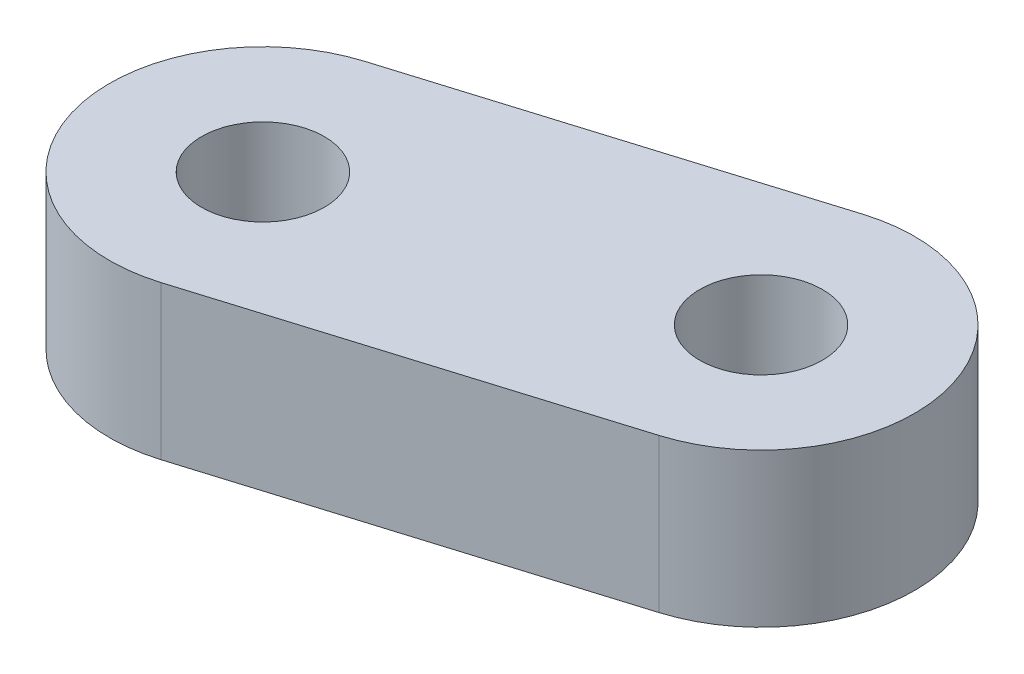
ISO-10303-21;
HEADER;
FILE_DESCRIPTION(('STEP AP214'),'2;1');
FILE_NAME('part.step','',(''),(''),'','','');
FILE_SCHEMA(('AUTOMOTIVE_DESIGN { 1 0 10303 214 1 1 1 1 }'));
ENDSEC;
DATA;
#1=APPLICATION_CONTEXT('core data for automotive mechanical design processes');
#2=APPLICATION_PROTOCOL_DEFINITION('international standard','automotive_design',2000,#1);
#3=PRODUCT_CONTEXT('',#1,'mechanical');
#4=PRODUCT('Part','Part','',(#3));
#5=PRODUCT_RELATED_PRODUCT_CATEGORY('part','',(#4));
#6=PRODUCT_DEFINITION_FORMATION('','',#4);
#7=PRODUCT_DEFINITION_CONTEXT('part definition',#1,'design');
#8=PRODUCT_DEFINITION('design','',#6,#7);
#9=PRODUCT_DEFINITION_SHAPE('','',#8);
#10=(LENGTH_UNIT() NAMED_UNIT(*) SI_UNIT(.MILLI.,.METRE.));
#11=(NAMED_UNIT(*) PLANE_ANGLE_UNIT() SI_UNIT($,.RADIAN.));
#12=(NAMED_UNIT(*) SI_UNIT($,.STERADIAN.) SOLID_ANGLE_UNIT());
#13=UNCERTAINTY_MEASURE_WITH_UNIT(LENGTH_MEASURE(1.E-05),#10,'distance_accuracy_value','');
#14=(GEOMETRIC_REPRESENTATION_CONTEXT(3) GLOBAL_UNCERTAINTY_ASSIGNED_CONTEXT((#13)) GLOBAL_UNIT_ASSIGNED_CONTEXT((#10,
#11,#12)) REPRESENTATION_CONTEXT('',''));
#15=CARTESIAN_POINT('',(0.,0.,0.));
#16=DIRECTION('',(0.,0.,1.));
#17=DIRECTION('',(1.,0.,0.));
#18=AXIS2_PLACEMENT_3D('',#15,#16,#17);
#19=CARTESIAN_POINT('',(12.4317873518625,-2.5,-3.80140279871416));
#20=DIRECTION('',(0.,-1.,0.));
#21=DIRECTION('',(-0.956291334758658,0.,0.292415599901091));
#22=AXIS2_PLACEMENT_3D('',#19,#20,#21);
#23=CYLINDRICAL_SURFACE('',#22,2.);
#24=CARTESIAN_POINT('',(12.4317873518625,-2.5,-3.80140279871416));
#25=DIRECTION('',(0.,-1.,0.));
#26=DIRECTION('',(-0.956291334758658,0.,0.292415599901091));
#27=AXIS2_PLACEMENT_3D('',#24,#25,#26);
#28=CIRCLE('',#27,2.);
#29=CARTESIAN_POINT('',(10.5192046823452,-2.5,-3.21657159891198));
#30=VERTEX_POINT('',#29);
#31=EDGE_CURVE('E83',#30,#30,#28,.T.);
#32=ORIENTED_EDGE('',*,*,#31,.T.);
#33=EDGE_LOOP('',(#32));
#34=FACE_BOUND('',#33,.T.);
#35=CARTESIAN_POINT('',(12.4317873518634,2.50000000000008,-3.80140279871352));
#36=DIRECTION('',(0.,-1.,0.));
#37=DIRECTION('',(-0.956291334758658,0.,0.29241559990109));
#38=AXIS2_PLACEMENT_3D('',#35,#36,#37);
#39=CIRCLE('',#38,2.);
#40=CARTESIAN_POINT('',(10.5192046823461,2.50000000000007,-3.21657159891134));
#41=VERTEX_POINT('',#40);
#42=EDGE_CURVE('E20',#41,#41,#39,.T.);
#43=ORIENTED_EDGE('',*,*,#42,.F.);
#44=EDGE_LOOP('',(#43));
#45=FACE_BOUND('',#44,.T.);
#46=ADVANCED_FACE('F16',(#34,#45),#23,.F.);
#47=CARTESIAN_POINT('',(0.,-2.5,0.));
#48=DIRECTION('',(0.,-1.,0.));
#49=DIRECTION('',(-0.956291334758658,0.,0.292415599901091));
#50=AXIS2_PLACEMENT_3D('',#47,#48,#49);
#51=CYLINDRICAL_SURFACE('',#50,2.);
#52=CARTESIAN_POINT('',(0.,-2.5,0.));
#53=DIRECTION('',(0.,-1.,0.));
#54=DIRECTION('',(-0.956291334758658,0.,0.292415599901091));
#55=AXIS2_PLACEMENT_3D('',#52,#53,#54);
#56=CIRCLE('',#55,2.);
#57=CARTESIAN_POINT('',(-1.91258266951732,-2.5,0.584831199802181));
#58=VERTEX_POINT('',#57);
#59=EDGE_CURVE('E98',#58,#58,#56,.T.);
#60=ORIENTED_EDGE('',*,*,#59,.T.);
#61=EDGE_LOOP('',(#60));
#62=FACE_BOUND('',#61,.T.);
#63=CARTESIAN_POINT('',(8.46545056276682E-13,2.5,6.53990750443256E-13));
#64=DIRECTION('',(0.,-1.,0.));
#65=DIRECTION('',(-0.956291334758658,0.,0.29241559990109));
#66=AXIS2_PLACEMENT_3D('',#63,#64,#65);
#67=CIRCLE('',#66,2.);
#68=CARTESIAN_POINT('',(-1.91258266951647,2.5,0.584831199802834));
#69=VERTEX_POINT('',#68);
#70=EDGE_CURVE('E78',#69,#69,#67,.T.);
#71=ORIENTED_EDGE('',*,*,#70,.F.);
#72=EDGE_LOOP('',(#71));
#73=FACE_BOUND('',#72,.T.);
#74=ADVANCED_FACE('F126',(#62,#73),#51,.F.);
#75=CARTESIAN_POINT('',(15.7511660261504,-2.49999999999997,-10.044937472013));
#76=DIRECTION('',(0.292415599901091,0.,0.956291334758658));
#77=DIRECTION('',(0.,1.,0.));
#78=AXIS2_PLACEMENT_3D('',#75,#76,#77);
#79=PLANE('',#78);
#80=DIRECTION('',(0.,1.,0.));
#81=VECTOR('',#80,1.);
#82=CARTESIAN_POINT('',(10.9697093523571,-2.49999999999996,-8.58285947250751));
#83=LINE('',#82,#81);
#84=CARTESIAN_POINT('',(10.9697093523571,-2.49999999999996,-8.58285947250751));
#85=VERTEX_POINT('',#84);
#86=CARTESIAN_POINT('',(10.9697093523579,2.50000000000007,-8.58285947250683));
#87=VERTEX_POINT('',#86);
#88=EDGE_CURVE('E87',#85,#87,#83,.T.);
#89=ORIENTED_EDGE('',*,*,#88,.F.);
#90=DIRECTION('',(0.956291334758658,0.,-0.292415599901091));
#91=VECTOR('',#90,1.);
#92=CARTESIAN_POINT('',(15.7511660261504,-2.49999999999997,-10.044937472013));
#93=LINE('',#92,#91);
#94=CARTESIAN_POINT('',(-1.46207799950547,-2.5,-4.78145667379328));
#95=VERTEX_POINT('',#94);
#96=EDGE_CURVE('E66',#85,#95,#93,.F.);
#97=ORIENTED_EDGE('',*,*,#96,.T.);
#98=DIRECTION('',(0.,1.,0.));
#99=VECTOR('',#98,1.);
#100=CARTESIAN_POINT('',(-1.46207799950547,-2.5,-4.78145667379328));
#101=LINE('',#100,#99);
#102=CARTESIAN_POINT('',(-1.4620779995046,2.50000000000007,-4.78145667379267));
#103=VERTEX_POINT('',#102);
#104=EDGE_CURVE('E59',#103,#95,#101,.F.);
#105=ORIENTED_EDGE('',*,*,#104,.F.);
#106=DIRECTION('',(-0.956291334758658,0.,0.29241559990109));
#107=VECTOR('',#106,1.);
#108=CARTESIAN_POINT('',(15.7511660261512,2.50000000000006,-10.0449374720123));
#109=LINE('',#108,#107);
#110=EDGE_CURVE('E63',#87,#103,#109,.T.);
#111=ORIENTED_EDGE('',*,*,#110,.F.);
#112=EDGE_LOOP('',(#89,#97,#105,#111));
#113=FACE_BOUND('',#112,.T.);
#114=ADVANCED_FACE('F61',(#113),#79,.F.);
#115=CARTESIAN_POINT('',(0.,-2.5,0.));
#116=DIRECTION('',(0.,1.,0.));
#117=DIRECTION('',(0.956291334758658,0.,-0.292415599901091));
#118=AXIS2_PLACEMENT_3D('',#115,#116,#117);
#119=CYLINDRICAL_SURFACE('',#118,5.);
#120=DIRECTION('',(0.,-1.,0.));
#121=VECTOR('',#120,1.);
#122=CARTESIAN_POINT('',(1.46207799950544,-2.5,4.78145667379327));
#123=LINE('',#122,#121);
#124=CARTESIAN_POINT('',(1.46207799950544,-2.5,4.78145667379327));
#125=VERTEX_POINT('',#124);
#126=CARTESIAN_POINT('',(1.46207799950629,2.5,4.78145667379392));
#127=VERTEX_POINT('',#126);
#128=EDGE_CURVE('E53',#125,#127,#123,.F.);
#129=ORIENTED_EDGE('',*,*,#128,.T.);
#130=CARTESIAN_POINT('',(8.46545056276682E-13,2.5,6.53990750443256E-13));
#131=DIRECTION('',(0.,1.,0.));
#132=DIRECTION('',(0.956291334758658,0.,-0.29241559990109));
#133=AXIS2_PLACEMENT_3D('',#130,#131,#132);
#134=CIRCLE('',#133,5.);
#135=EDGE_CURVE('E70',#127,#103,#134,.F.);
#136=ORIENTED_EDGE('',*,*,#135,.T.);
#137=ORIENTED_EDGE('',*,*,#104,.T.);
#138=CARTESIAN_POINT('',(0.,-2.5,0.));
#139=DIRECTION('',(0.,1.,0.));
#140=DIRECTION('',(0.956291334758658,0.,-0.292415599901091));
#141=AXIS2_PLACEMENT_3D('',#138,#139,#140);
#142=CIRCLE('',#141,5.);
#143=EDGE_CURVE('E97',#95,#125,#142,.T.);
#144=ORIENTED_EDGE('',*,*,#143,.T.);
#145=EDGE_LOOP('',(#129,#136,#137,#144));
#146=FACE_BOUND('',#145,.T.);
#147=ADVANCED_FACE('F71',(#146),#119,.T.);
#148=CARTESIAN_POINT('',(18.6753220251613,-2.5,-0.482024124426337));
#149=DIRECTION('',(-0.292415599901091,0.,-0.956291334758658));
#150=DIRECTION('',(0.,-1.,0.));
#151=AXIS2_PLACEMENT_3D('',#148,#149,#150);
#152=PLANE('',#151);
#153=ORIENTED_EDGE('',*,*,#128,.F.);
#154=DIRECTION('',(0.956291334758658,0.,-0.292415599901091));
#155=VECTOR('',#154,1.);
#156=CARTESIAN_POINT('',(18.6753220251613,-2.5,-0.482024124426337));
#157=LINE('',#156,#155);
#158=CARTESIAN_POINT('',(13.893865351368,-2.5,0.980053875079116));
#159=VERTEX_POINT('',#158);
#160=EDGE_CURVE('E26',#125,#159,#157,.T.);
#161=ORIENTED_EDGE('',*,*,#160,.T.);
#162=DIRECTION('',(0.,1.,0.));
#163=VECTOR('',#162,1.);
#164=CARTESIAN_POINT('',(13.893865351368,-2.5,0.980053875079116));
#165=LINE('',#164,#163);
#166=CARTESIAN_POINT('',(13.8938653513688,2.5,0.98005387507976));
#167=VERTEX_POINT('',#166);
#168=EDGE_CURVE('E34',#167,#159,#165,.F.);
#169=ORIENTED_EDGE('',*,*,#168,.F.);
#170=DIRECTION('',(-0.956291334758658,0.,0.29241559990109));
#171=VECTOR('',#170,1.);
#172=CARTESIAN_POINT('',(18.6753220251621,2.5,-0.482024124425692));
#173=LINE('',#172,#171);
#174=EDGE_CURVE('E75',#127,#167,#173,.F.);
#175=ORIENTED_EDGE('',*,*,#174,.F.);
#176=EDGE_LOOP('',(#153,#161,#169,#175));
#177=FACE_BOUND('',#176,.T.);
#178=ADVANCED_FACE('F89',(#177),#152,.F.);
#179=CARTESIAN_POINT('',(12.4317873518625,-2.5,-3.80140279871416));
#180=DIRECTION('',(0.,1.,0.));
#181=DIRECTION('',(0.956291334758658,0.,-0.292415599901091));
#182=AXIS2_PLACEMENT_3D('',#179,#180,#181);
#183=CYLINDRICAL_SURFACE('',#182,5.);
#184=ORIENTED_EDGE('',*,*,#88,.T.);
#185=CARTESIAN_POINT('',(12.4317873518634,2.50000000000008,-3.80140279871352));
#186=DIRECTION('',(0.,1.,0.));
#187=DIRECTION('',(0.956291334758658,0.,-0.29241559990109));
#188=AXIS2_PLACEMENT_3D('',#185,#186,#187);
#189=CIRCLE('',#188,5.);
#190=EDGE_CURVE('E68',#87,#167,#189,.F.);
#191=ORIENTED_EDGE('',*,*,#190,.T.);
#192=ORIENTED_EDGE('',*,*,#168,.T.);
#193=CARTESIAN_POINT('',(12.4317873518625,-2.5,-3.80140279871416));
#194=DIRECTION('',(0.,1.,0.));
#195=DIRECTION('',(0.956291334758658,0.,-0.292415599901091));
#196=AXIS2_PLACEMENT_3D('',#193,#194,#195);
#197=CIRCLE('',#196,5.);
#198=EDGE_CURVE('E11',#159,#85,#197,.T.);
#199=ORIENTED_EDGE('',*,*,#198,.T.);
#200=EDGE_LOOP('',(#184,#191,#192,#199));
#201=FACE_BOUND('',#200,.T.);
#202=ADVANCED_FACE('F86',(#201),#183,.T.);
#203=CARTESIAN_POINT('',(15.7511660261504,-2.49999999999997,-10.044937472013));
#204=DIRECTION('',(0.,1.,0.));
#205=DIRECTION('',(0.956291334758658,0.,-0.292415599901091));
#206=AXIS2_PLACEMENT_3D('',#203,#204,#205);
#207=PLANE('',#206);
#208=ORIENTED_EDGE('',*,*,#198,.F.);
#209=ORIENTED_EDGE('',*,*,#160,.F.);
#210=ORIENTED_EDGE('',*,*,#143,.F.);
#211=ORIENTED_EDGE('',*,*,#96,.F.);
#212=EDGE_LOOP('',(#208,#209,#210,#211));
#213=FACE_BOUND('',#212,.T.);
#214=ORIENTED_EDGE('',*,*,#59,.F.);
#215=EDGE_LOOP('',(#214));
#216=FACE_BOUND('',#215,.T.);
#217=ORIENTED_EDGE('',*,*,#31,.F.);
#218=EDGE_LOOP('',(#217));
#219=FACE_BOUND('',#218,.T.);
#220=ADVANCED_FACE('F107',(#213,#216,#219),#207,.F.);
#221=CARTESIAN_POINT('',(15.7511660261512,2.50000000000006,-10.0449374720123));
#222=DIRECTION('',(0.,1.,0.));
#223=DIRECTION('',(0.956291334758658,0.,-0.29241559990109));
#224=AXIS2_PLACEMENT_3D('',#221,#222,#223);
#225=PLANE('',#224);
#226=ORIENTED_EDGE('',*,*,#110,.T.);
#227=ORIENTED_EDGE('',*,*,#135,.F.);
#228=ORIENTED_EDGE('',*,*,#174,.T.);
#229=ORIENTED_EDGE('',*,*,#190,.F.);
#230=EDGE_LOOP('',(#226,#227,#228,#229));
#231=FACE_BOUND('',#230,.T.);
#232=ORIENTED_EDGE('',*,*,#70,.T.);
#233=EDGE_LOOP('',(#232));
#234=FACE_BOUND('',#233,.T.);
#235=ORIENTED_EDGE('',*,*,#42,.T.);
#236=EDGE_LOOP('',(#235));
#237=FACE_BOUND('',#236,.T.);
#238=ADVANCED_FACE('F18',(#231,#234,#237),#225,.T.);
#239=CLOSED_SHELL('',(#46,#74,#114,#147,#178,#202,#220,#238));
#240=MANIFOLD_SOLID_BREP('B1',#239);
#241=ADVANCED_BREP_SHAPE_REPRESENTATION('',(#18,#240),#14);
#242=SHAPE_DEFINITION_REPRESENTATION(#9,#241);
ENDSEC;
END-ISO-10303-21;
